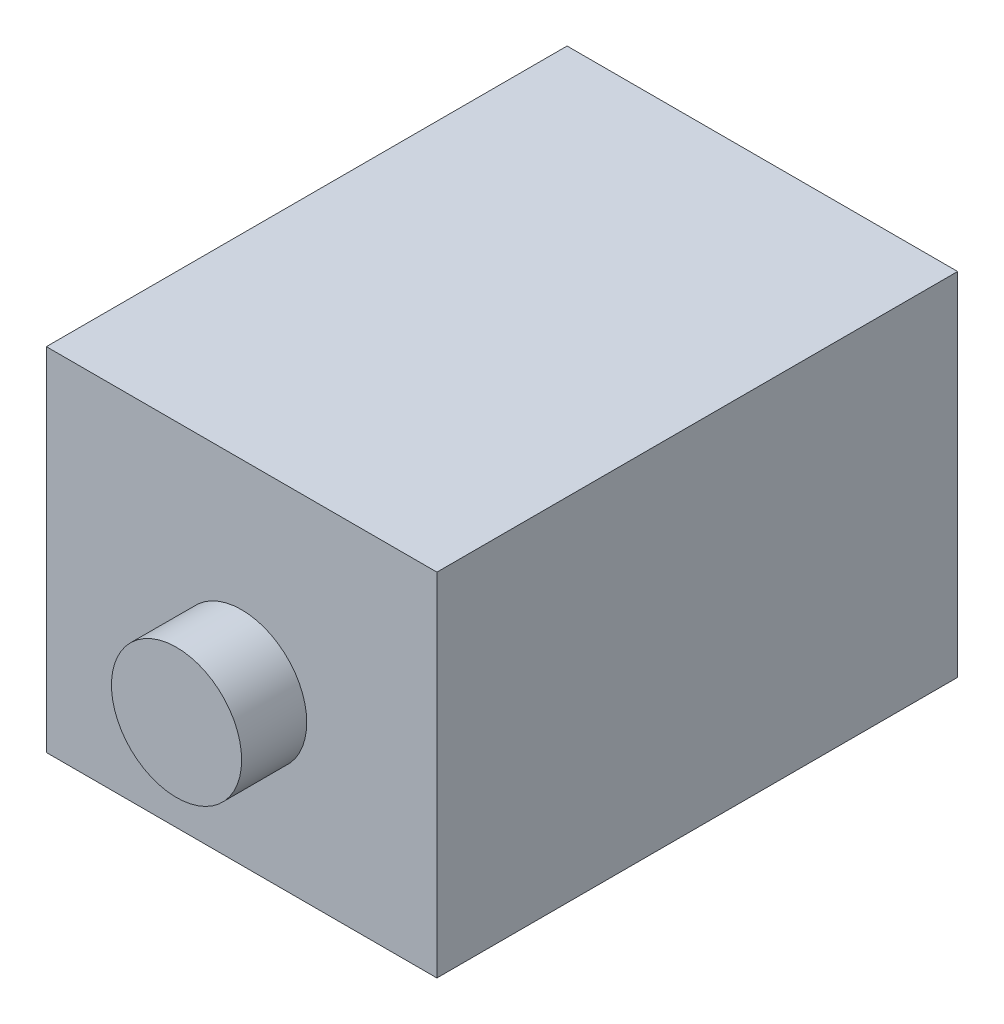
from build123d import *

# Parameters (mm, degrees)
SKETCH_1_W                           = 30
SKETCH_1_H                           = 30
GEARED_MOTOR_ENVELOPE_30X30X40_DEPTH = 20
SKETCH_2_W                           = 30
SKETCH_2_H                           = 4
MOTOR_MOUNT_FOOT_DEPTH               = 20
SKETCH_3_R                           = 5
COUPLER_ENVELOPE_D10_DEPTH           = 25
SKETCH_4_W                           = 60
SKETCH_4_H                           = 40
MOTOR_HEIGHT_CLEARANCE_DEPTH         = 50
SKETCH_5_W                           = 30
SKETCH_5_H                           = 2
MOTOR_FOOT_YMINUS12_DEPTH            = 20
TRIM_BACK_SHAFT_AT_ZMINUS20_START    = -20
SKETCH_6_W                           = 100
SKETCH_6_H                           = 100
TRIM_BACK_SHAFT_AT_ZMINUS20_DEPTH    = 100


with BuildPart() as part:
    # Sketch 1 → Geared_Motor_Envelope_30x30x40 (new, symmetric)
    with BuildSketch(Plane.XY):
        Rectangle(SKETCH_1_W, SKETCH_1_H)
    extrude(amount=GEARED_MOTOR_ENVELOPE_30X30X40_DEPTH, both=True)

    # Sketch 2 → Motor_Mount_Foot (add, symmetric)
    with BuildSketch(Plane.XY):
        with Locations((0, -17)):
            Rectangle(SKETCH_2_W, SKETCH_2_H)
    extrude(amount=MOTOR_MOUNT_FOOT_DEPTH, both=True)

    # Sketch 3 → Coupler_Envelope_D10 (add, symmetric)
    with BuildSketch(Plane.XY):
        Circle(SKETCH_3_R)
    extrude(amount=COUPLER_ENVELOPE_D10_DEPTH, both=True)

    # Sketch 4 → Motor_Height_Clearance (cut, symmetric)
    with BuildSketch(Plane.XY):
        with Locations((0, -30)):
            Rectangle(SKETCH_4_W, SKETCH_4_H)
    extrude(amount=MOTOR_HEIGHT_CLEARANCE_DEPTH, both=True, mode=Mode.SUBTRACT)

    # Sketch 5 → Motor_Foot_Yminus12 (add, symmetric)
    with BuildSketch(Plane.XY):
        with Locations((0, -11)):
            Rectangle(SKETCH_5_W, SKETCH_5_H)
    extrude(amount=MOTOR_FOOT_YMINUS12_DEPTH, both=True)

    # Sketch 6 → Trim_Back_Shaft_At_Zminus20 (cut)
    with BuildSketch(Plane.XY.offset(TRIM_BACK_SHAFT_AT_ZMINUS20_START)):
        Rectangle(SKETCH_6_W, SKETCH_6_H)
    extrude(amount=-TRIM_BACK_SHAFT_AT_ZMINUS20_DEPTH, mode=Mode.SUBTRACT)


solid = part.part
